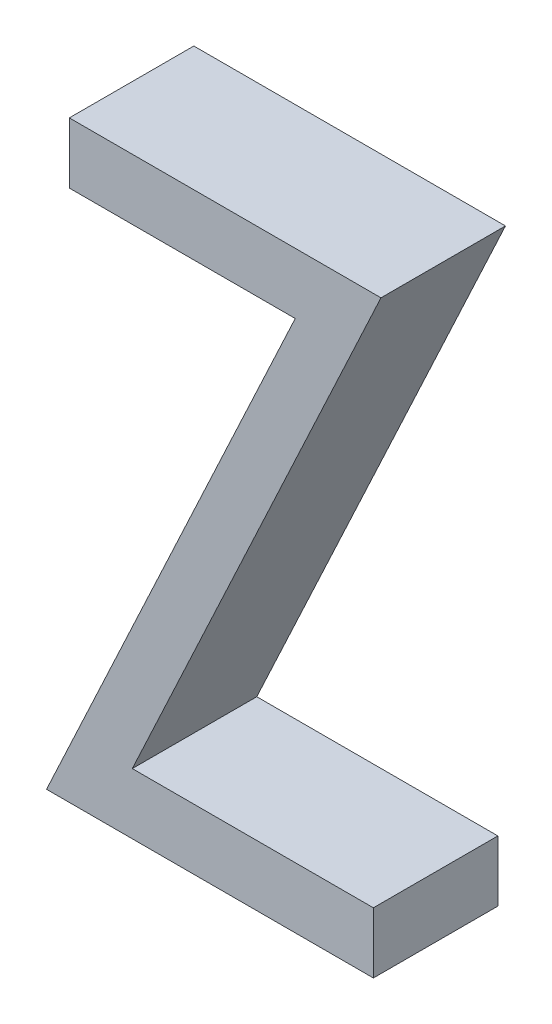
from build123d import *

# Parameters (mm, degrees)
BOSS_EXTRU_1_DEPTH = 2


with BuildPart() as part:
    # Esquisse1 → Boss.-Extru.1 (new, symmetric)
    with BuildSketch(Plane.XY):
        Polygon((-32.784981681, 226.305606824), (-32.784981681, 228.259452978), (-22.771520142, 228.259452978), (-30.762445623, 211.163299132), (-23.015750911, 211.163299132), (-23.015750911, 209.209452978), (-33.517673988, 209.209452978), (-25.526748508, 226.305606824), align=None)
    extrude(amount=BOSS_EXTRU_1_DEPTH, both=True)


solid = part.part
